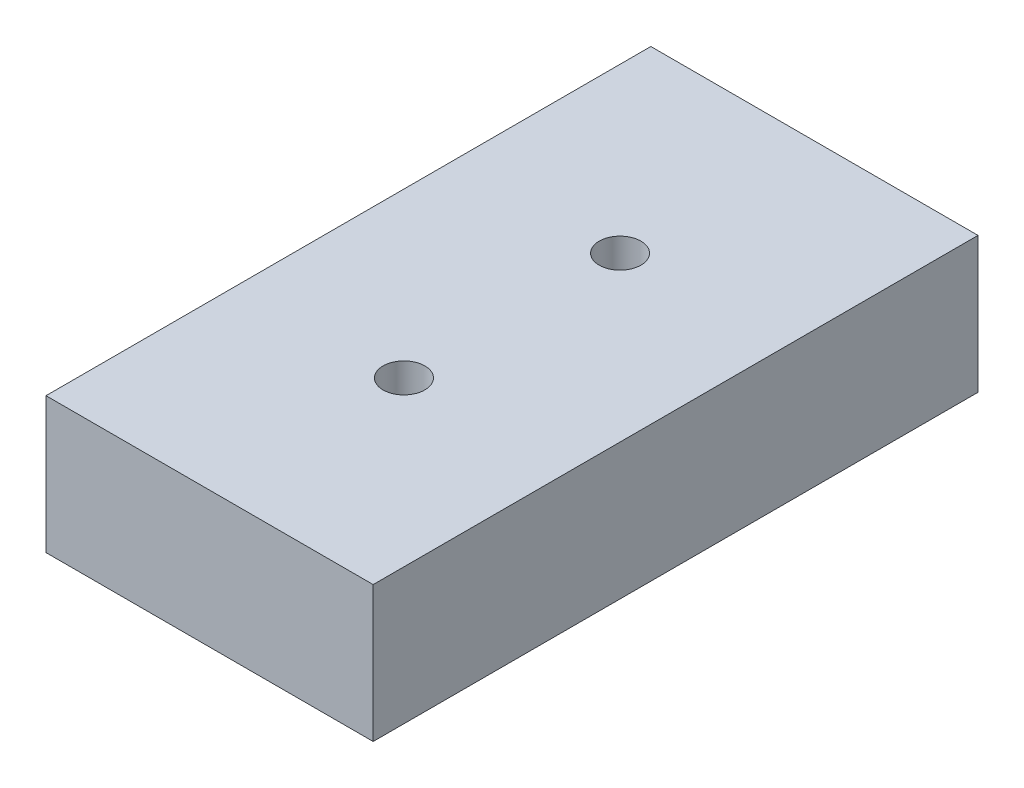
from build123d import *

# Parameters (mm, degrees)
SKETCH1_W           = 33.7
SKETCH1_H           = 62.3
SKETCH1_R           = 2.15
BOSS_EXTRUDE1_DEPTH = 14


with BuildPart() as part:
    # Sketch1 → Boss-Extrude1 (new body)
    with BuildSketch(Plane(origin=(0, 0, 0), x_dir=(1, 0, 0), z_dir=(0, 1, 0))):
        Rectangle(SKETCH1_W, SKETCH1_H)
        with Locations(Location((0, 11.13, 0), (0, 0, 270))):
            Circle(SKETCH1_R, mode=Mode.SUBTRACT)
        with Locations(Location((0, -11.13, 0), (0, 0, 270))):
            Circle(SKETCH1_R, mode=Mode.SUBTRACT)
    extrude(amount=BOSS_EXTRUDE1_DEPTH)


solid = part.part
